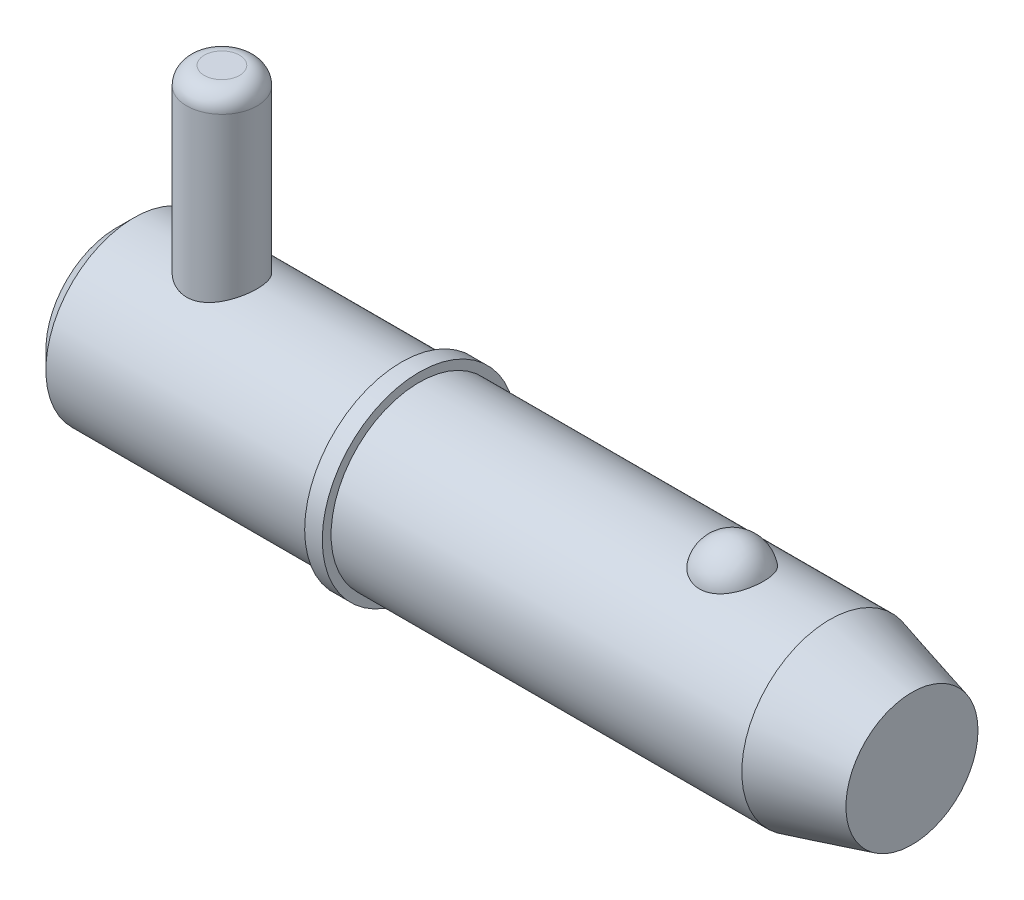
ISO-10303-21;
HEADER;
FILE_DESCRIPTION(('STEP AP214'),'2;1');
FILE_NAME('part.step','',(''),(''),'','','');
FILE_SCHEMA(('AUTOMOTIVE_DESIGN { 1 0 10303 214 1 1 1 1 }'));
ENDSEC;
DATA;
#1=APPLICATION_CONTEXT('core data for automotive mechanical design processes');
#2=APPLICATION_PROTOCOL_DEFINITION('international standard','automotive_design',2000,#1);
#3=PRODUCT_CONTEXT('',#1,'mechanical');
#4=PRODUCT('Part','Part','',(#3));
#5=PRODUCT_RELATED_PRODUCT_CATEGORY('part','',(#4));
#6=PRODUCT_DEFINITION_FORMATION('','',#4);
#7=PRODUCT_DEFINITION_CONTEXT('part definition',#1,'design');
#8=PRODUCT_DEFINITION('design','',#6,#7);
#9=PRODUCT_DEFINITION_SHAPE('','',#8);
#10=(LENGTH_UNIT() NAMED_UNIT(*) SI_UNIT(.MILLI.,.METRE.));
#11=(NAMED_UNIT(*) PLANE_ANGLE_UNIT() SI_UNIT($,.RADIAN.));
#12=(NAMED_UNIT(*) SI_UNIT($,.STERADIAN.) SOLID_ANGLE_UNIT());
#13=UNCERTAINTY_MEASURE_WITH_UNIT(LENGTH_MEASURE(1.E-05),#10,'distance_accuracy_value','');
#14=(GEOMETRIC_REPRESENTATION_CONTEXT(3) GLOBAL_UNCERTAINTY_ASSIGNED_CONTEXT((#13)) GLOBAL_UNIT_ASSIGNED_CONTEXT((#10,
#11,#12)) REPRESENTATION_CONTEXT('',''));
#15=CARTESIAN_POINT('',(0.,0.,0.));
#16=DIRECTION('',(0.,0.,1.));
#17=DIRECTION('',(1.,0.,0.));
#18=AXIS2_PLACEMENT_3D('',#15,#16,#17);
#19=CARTESIAN_POINT('',(9.525,23.81,0.));
#20=DIRECTION('',(0.,-1.,0.));
#21=DIRECTION('',(0.,0.,-1.));
#22=AXIS2_PLACEMENT_3D('',#19,#20,#21);
#23=CYLINDRICAL_SURFACE('',#22,3.175);
#24=CARTESIAN_POINT('',(9.525,-6.3525,0.));
#25=DIRECTION('',(0.,1.,0.));
#26=DIRECTION('',(0.,0.,1.));
#27=AXIS2_PLACEMENT_3D('',#24,#25,#26);
#28=CIRCLE('',#27,3.175);
#29=CARTESIAN_POINT('',(9.525,-6.3525,3.175));
#30=VERTEX_POINT('',#29);
#31=EDGE_CURVE('P0_E25',#30,#30,#28,.T.);
#32=ORIENTED_EDGE('',*,*,#31,.T.);
#33=EDGE_LOOP('',(#32));
#34=FACE_BOUND('',#33,.T.);
#35=CARTESIAN_POINT('',(9.525,22.2225,0.));
#36=DIRECTION('',(0.,1.,0.));
#37=DIRECTION('',(0.,0.,1.));
#38=AXIS2_PLACEMENT_3D('',#35,#36,#37);
#39=CIRCLE('',#38,3.175);
#40=CARTESIAN_POINT('',(9.525,22.2225,3.175));
#41=VERTEX_POINT('',#40);
#42=EDGE_CURVE('P0_E29',#41,#41,#39,.F.);
#43=ORIENTED_EDGE('',*,*,#42,.T.);
#44=EDGE_LOOP('',(#43));
#45=FACE_BOUND('',#44,.T.);
#46=ADVANCED_FACE('P0_F14',(#34,#45),#23,.T.);
#47=CARTESIAN_POINT('',(9.525,23.81,0.));
#48=DIRECTION('',(0.,1.,0.));
#49=DIRECTION('',(0.,0.,1.));
#50=AXIS2_PLACEMENT_3D('',#47,#48,#49);
#51=PLANE('',#50);
#52=CARTESIAN_POINT('',(9.525,23.81,0.));
#53=DIRECTION('',(0.,1.,0.));
#54=DIRECTION('',(0.,0.,1.));
#55=AXIS2_PLACEMENT_3D('',#52,#53,#54);
#56=CIRCLE('',#55,1.5875);
#57=CARTESIAN_POINT('',(9.525,23.81,1.5875));
#58=VERTEX_POINT('',#57);
#59=EDGE_CURVE('P0_E10',#58,#58,#56,.T.);
#60=ORIENTED_EDGE('',*,*,#59,.T.);
#61=EDGE_LOOP('',(#60));
#62=FACE_BOUND('',#61,.T.);
#63=ADVANCED_FACE('P0_F46',(#62),#51,.T.);
#64=CARTESIAN_POINT('',(9.525,-7.94,0.));
#65=DIRECTION('',(0.,1.,0.));
#66=DIRECTION('',(0.,0.,1.));
#67=AXIS2_PLACEMENT_3D('',#64,#65,#66);
#68=PLANE('',#67);
#69=CARTESIAN_POINT('',(9.525,-7.94,0.));
#70=DIRECTION('',(0.,1.,0.));
#71=DIRECTION('',(0.,0.,1.));
#72=AXIS2_PLACEMENT_3D('',#69,#70,#71);
#73=CIRCLE('',#72,1.5875);
#74=CARTESIAN_POINT('',(9.525,-7.94,1.5875));
#75=VERTEX_POINT('',#74);
#76=EDGE_CURVE('P0_E21',#75,#75,#73,.F.);
#77=ORIENTED_EDGE('',*,*,#76,.T.);
#78=EDGE_LOOP('',(#77));
#79=FACE_BOUND('',#78,.T.);
#80=ADVANCED_FACE('P0_F43',(#79),#68,.F.);
#81=CARTESIAN_POINT('',(9.525,-6.3525,0.));
#82=DIRECTION('',(0.,1.,0.));
#83=DIRECTION('',(0.,0.,1.));
#84=AXIS2_PLACEMENT_3D('',#81,#82,#83);
#85=DEGENERATE_TOROIDAL_SURFACE('',#84,1.5875,1.5875,.T.);
#86=ORIENTED_EDGE('',*,*,#76,.F.);
#87=EDGE_LOOP('',(#86));
#88=FACE_BOUND('',#87,.T.);
#89=ORIENTED_EDGE('',*,*,#31,.F.);
#90=EDGE_LOOP('',(#89));
#91=FACE_BOUND('',#90,.T.);
#92=ADVANCED_FACE('P0_F38',(#88,#91),#85,.T.);
#93=CARTESIAN_POINT('',(9.525,22.2225,0.));
#94=DIRECTION('',(0.,1.,0.));
#95=DIRECTION('',(0.,0.,1.));
#96=AXIS2_PLACEMENT_3D('',#93,#94,#95);
#97=DEGENERATE_TOROIDAL_SURFACE('',#96,1.5875,1.5875,.T.);
#98=ORIENTED_EDGE('',*,*,#42,.F.);
#99=EDGE_LOOP('',(#98));
#100=FACE_BOUND('',#99,.T.);
#101=ORIENTED_EDGE('',*,*,#59,.F.);
#102=EDGE_LOOP('',(#101));
#103=FACE_BOUND('',#102,.T.);
#104=ADVANCED_FACE('P0_F16',(#100,#103),#97,.T.);
#105=CLOSED_SHELL('',(#46,#63,#80,#92,#104));
#106=MANIFOLD_SOLID_BREP('P0_B1',#105);
#107=CARTESIAN_POINT('',(0.,0.,0.));
#108=DIRECTION('',(1.,0.,0.));
#109=DIRECTION('',(0.,0.,-1.));
#110=AXIS2_PLACEMENT_3D('',#107,#108,#109);
#111=CYLINDRICAL_SURFACE('',#110,7.94);
#112=CARTESIAN_POINT('',(64.3518791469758,0.,0.));
#113=DIRECTION('',(1.,0.,0.));
#114=DIRECTION('',(0.,0.,-1.));
#115=AXIS2_PLACEMENT_3D('',#112,#113,#114);
#116=CIRCLE('',#115,7.94);
#117=CARTESIAN_POINT('',(64.3518791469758,0.,-7.94));
#118=VERTEX_POINT('',#117);
#119=EDGE_CURVE('P1_E81',#118,#118,#116,.T.);
#120=ORIENTED_EDGE('',*,*,#119,.F.);
#121=EDGE_LOOP('',(#120));
#122=FACE_BOUND('',#121,.T.);
#123=CARTESIAN_POINT('',(27.31,0.,0.));
#124=DIRECTION('',(1.,0.,0.));
#125=DIRECTION('',(0.,0.,-1.));
#126=AXIS2_PLACEMENT_3D('',#123,#124,#125);
#127=CIRCLE('',#126,7.94);
#128=CARTESIAN_POINT('',(27.31,0.,-7.94));
#129=VERTEX_POINT('',#128);
#130=EDGE_CURVE('P1_E85',#129,#129,#127,.T.);
#131=ORIENTED_EDGE('',*,*,#130,.T.);
#132=EDGE_LOOP('',(#131));
#133=FACE_BOUND('',#132,.T.);
#134=CARTESIAN_POINT('',(55.5449074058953,7.37767842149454,2.93486986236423));
#135=CARTESIAN_POINT('',(55.3927496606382,7.3776732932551,2.93487505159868));
#136=CARTESIAN_POINT('',(55.2406329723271,7.38258419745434,2.92262454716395));
#137=CARTESIAN_POINT('',(54.9409284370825,7.40163229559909,2.87404196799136));
#138=CARTESIAN_POINT('',(54.7933394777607,7.41576720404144,2.83771585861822));
#139=CARTESIAN_POINT('',(54.5070187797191,7.4516157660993,2.74218769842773));
#140=CARTESIAN_POINT('',(54.3682745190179,7.47331841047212,2.68301886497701));
#141=CARTESIAN_POINT('',(54.1028822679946,7.52194082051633,2.54350967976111));
#142=CARTESIAN_POINT('',(53.9762366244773,7.5488615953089,2.46316523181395));
#143=CARTESIAN_POINT('',(53.7345349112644,7.60594671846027,2.2809037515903));
#144=CARTESIAN_POINT('',(53.6199065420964,7.63618114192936,2.17844211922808));
#145=CARTESIAN_POINT('',(53.4088787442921,7.69614046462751,1.95608495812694));
#146=CARTESIAN_POINT('',(53.3124826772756,7.72586526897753,1.83618622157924));
#147=CARTESIAN_POINT('',(53.1359381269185,7.78314821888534,1.57628086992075));
#148=CARTESIAN_POINT('',(53.0567072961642,7.81055035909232,1.43561546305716));
#149=CARTESIAN_POINT('',(52.9217979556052,7.85879631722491,1.14236334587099));
#150=CARTESIAN_POINT('',(52.8661216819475,7.87963951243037,0.989775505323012));
#151=CARTESIAN_POINT('',(52.7788121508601,7.91289645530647,0.674619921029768));
#152=CARTESIAN_POINT('',(52.7475309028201,7.925186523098,0.511941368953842));
#153=CARTESIAN_POINT('',(52.710975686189,7.93958930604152,0.183247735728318));
#154=CARTESIAN_POINT('',(52.7057012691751,7.94170219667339,0.0172327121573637));
#155=CARTESIAN_POINT('',(52.7212311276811,7.93554931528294,-0.31267286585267));
#156=CARTESIAN_POINT('',(52.7419253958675,7.92732732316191,-0.4765694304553));
#157=CARTESIAN_POINT('',(52.8087865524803,7.90141534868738,-0.798305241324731));
#158=CARTESIAN_POINT('',(52.8549539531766,7.88372517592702,-0.956144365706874));
#159=CARTESIAN_POINT('',(52.9718986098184,7.84066230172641,-1.26152073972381));
#160=CARTESIAN_POINT('',(53.0427046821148,7.81528060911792,-1.40904568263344));
#161=CARTESIAN_POINT('',(53.2074789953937,7.7594867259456,-1.68950598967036));
#162=CARTESIAN_POINT('',(53.3014488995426,7.72907417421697,-1.82244030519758));
#163=CARTESIAN_POINT('',(53.5108391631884,7.66640424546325,-2.07032792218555));
#164=CARTESIAN_POINT('',(53.6263152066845,7.63414223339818,-2.1852330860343));
#165=CARTESIAN_POINT('',(53.8759006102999,7.57149681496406,-2.39329737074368));
#166=CARTESIAN_POINT('',(54.0100080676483,7.54111321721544,-2.48645870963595));
#167=CARTESIAN_POINT('',(54.2901113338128,7.48650742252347,-2.64628132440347));
#168=CARTESIAN_POINT('',(54.4357605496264,7.46215900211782,-2.71350554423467));
#169=CARTESIAN_POINT('',(54.7374259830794,7.42171253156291,-2.82226614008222));
#170=CARTESIAN_POINT('',(54.8934383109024,7.40561140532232,-2.86381209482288));
#171=CARTESIAN_POINT('',(55.2029708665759,7.3842679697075,-2.9183907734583));
#172=CARTESIAN_POINT('',(55.3562229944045,7.37852109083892,-2.93275024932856));
#173=CARTESIAN_POINT('',(55.6630705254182,7.37700973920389,-2.93655208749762));
#174=CARTESIAN_POINT('',(55.8166658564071,7.38124333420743,-2.92599927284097));
#175=CARTESIAN_POINT('',(56.1149907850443,7.39890635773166,-2.88102897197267));
#176=CARTESIAN_POINT('',(56.2598480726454,7.41205491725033,-2.8473399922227));
#177=CARTESIAN_POINT('',(56.5416432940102,7.445801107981,-2.75788206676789));
#178=CARTESIAN_POINT('',(56.6785805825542,7.46639934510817,-2.70211132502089));
#179=CARTESIAN_POINT('',(56.9440619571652,7.51339098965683,-2.56858908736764));
#180=CARTESIAN_POINT('',(57.0723548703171,7.53990200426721,-2.49038067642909));
#181=CARTESIAN_POINT('',(57.3142440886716,7.59569503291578,-2.31462737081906));
#182=CARTESIAN_POINT('',(57.4278370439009,7.62497767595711,-2.21707808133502));
#183=CARTESIAN_POINT('',(57.64322156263,7.68489473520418,-1.99982049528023));
#184=CARTESIAN_POINT('',(57.7441488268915,7.71552419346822,-1.87925337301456));
#185=CARTESIAN_POINT('',(57.9251866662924,7.77353016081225,-1.62268826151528));
#186=CARTESIAN_POINT('',(58.0052934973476,7.80090608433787,-1.4866875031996));
#187=CARTESIAN_POINT('',(58.1453615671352,7.85047992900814,-1.19818413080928));
#188=CARTESIAN_POINT('',(58.2045877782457,7.8724818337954,-1.04529016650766));
#189=CARTESIAN_POINT('',(58.2979821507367,7.90785114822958,-0.731080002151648));
#190=CARTESIAN_POINT('',(58.3321497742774,7.92121837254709,-0.569763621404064));
#191=CARTESIAN_POINT('',(58.374795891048,7.93797834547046,-0.242812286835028));
#192=CARTESIAN_POINT('',(58.3832047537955,7.94134405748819,-0.0771668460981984));
#193=CARTESIAN_POINT('',(58.3739626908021,7.93767937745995,0.253276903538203));
#194=CARTESIAN_POINT('',(58.3563120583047,7.93064910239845,0.418075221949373));
#195=CARTESIAN_POINT('',(58.2954247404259,7.90695571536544,0.741525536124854));
#196=CARTESIAN_POINT('',(58.2522819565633,7.8903279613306,0.900197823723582));
#197=CARTESIAN_POINT('',(58.1413535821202,7.84916386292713,1.20759654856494));
#198=CARTESIAN_POINT('',(58.07356656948,7.82462706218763,1.35632241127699));
#199=CARTESIAN_POINT('',(57.9143718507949,7.7700669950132,1.64032869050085));
#200=CARTESIAN_POINT('',(57.8228616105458,7.7400200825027,1.77554712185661));
#201=CARTESIAN_POINT('',(57.6182960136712,7.67774175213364,2.02800648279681));
#202=CARTESIAN_POINT('',(57.5052410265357,7.64551037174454,2.14524772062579));
#203=CARTESIAN_POINT('',(57.2608318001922,7.58265895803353,2.35778002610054));
#204=CARTESIAN_POINT('',(57.1295833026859,7.5520309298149,2.45319004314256));
#205=CARTESIAN_POINT('',(56.851601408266,7.49579792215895,2.61999897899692));
#206=CARTESIAN_POINT('',(56.7048670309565,7.47019326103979,2.69139637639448));
#207=CARTESIAN_POINT('',(56.3929477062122,7.42622216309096,2.8105324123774));
#208=CARTESIAN_POINT('',(56.2272209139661,7.40825002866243,2.85700910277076));
#209=CARTESIAN_POINT('',(55.8892792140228,7.38398348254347,2.9191685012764));
#210=CARTESIAN_POINT('',(55.7170670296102,7.3776842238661,2.93486399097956));
#211=CARTESIAN_POINT('',(55.5449074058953,7.37767842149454,2.93486986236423));
#212=B_SPLINE_CURVE_WITH_KNOTS('',3,(#134,#135,#136,#137,#138,#139,#140,#141,#142,#143,#144,
#145,#146,#147,#148,#149,#150,#151,#152,#153,#154,#155,#156,#157,#158,#159,#160,#161,#162,#163,
#164,#165,#166,#167,#168,#169,#170,#171,#172,#173,#174,#175,#176,#177,#178,#179,#180,#181,#182,
#183,#184,#185,#186,#187,#188,#189,#190,#191,#192,#193,#194,#195,#196,#197,#198,#199,#200,#201,
#202,#203,#204,#205,#206,#207,#208,#209,#210,#211),.UNSPECIFIED.,.T.,.F.,(4,2,2,2,2,2,2,2,2,2,2,
2,2,2,2,2,2,2,2,2,2,2,2,2,2,2,2,2,2,2,2,2,2,2,2,2,2,2,4),(0.,0.45584132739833,0.911569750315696,
1.36663794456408,1.82179423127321,2.28978983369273,2.7578716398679,3.246853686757,
3.73588214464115,4.23184282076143,4.72779494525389,5.22165321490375,5.71552141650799,
6.20996917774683,6.70445245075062,7.20023431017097,7.69596557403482,8.18023418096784,
8.66432203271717,9.12410697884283,9.58380291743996,10.0296503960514,10.4755341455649,
10.9312349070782,11.3870393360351,11.8654416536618,12.3439299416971,12.8378875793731,
13.3318558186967,13.8271581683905,14.3224549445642,14.8159385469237,15.3094506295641,
15.8051323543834,16.3008055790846,16.7937101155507,17.2866458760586,17.8026240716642,
18.3183879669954),.UNSPECIFIED.);
#213=CARTESIAN_POINT('',(55.5449074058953,7.37767842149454,2.93486986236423));
#214=VERTEX_POINT('',#213);
#215=EDGE_CURVE('P1_E35',#214,#214,#212,.T.);
#216=ORIENTED_EDGE('',*,*,#215,.T.);
#217=EDGE_LOOP('',(#216));
#218=FACE_BOUND('',#217,.T.);
#219=ADVANCED_FACE('P1_F13',(#122,#133,#218),#111,.T.);
#220=CARTESIAN_POINT('',(0.,0.,0.));
#221=DIRECTION('',(-1.,0.,0.));
#222=DIRECTION('',(0.,0.,1.));
#223=AXIS2_PLACEMENT_3D('',#220,#221,#222);
#224=PLANE('',#223);
#225=CARTESIAN_POINT('',(0.,0.,0.));
#226=DIRECTION('',(1.,0.,0.));
#227=DIRECTION('',(0.,0.,-1.));
#228=AXIS2_PLACEMENT_3D('',#225,#226,#227);
#229=CIRCLE('',#228,6.352);
#230=CARTESIAN_POINT('',(0.,0.,-6.352));
#231=VERTEX_POINT('',#230);
#232=EDGE_CURVE('P1_E9',#231,#231,#229,.T.);
#233=ORIENTED_EDGE('',*,*,#232,.F.);
#234=EDGE_LOOP('',(#233));
#235=FACE_BOUND('',#234,.T.);
#236=ADVANCED_FACE('P1_F15',(#235),#224,.T.);
#237=CARTESIAN_POINT('',(1.58799999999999,0.,0.));
#238=DIRECTION('',(1.,0.,0.));
#239=DIRECTION('',(0.,0.,-1.));
#240=AXIS2_PLACEMENT_3D('',#237,#238,#239);
#241=CONICAL_SURFACE('',#240,7.94,0.78539816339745);
#242=ORIENTED_EDGE('',*,*,#232,.T.);
#243=EDGE_LOOP('',(#242));
#244=FACE_BOUND('',#243,.T.);
#245=CARTESIAN_POINT('',(1.58799999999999,0.,0.));
#246=DIRECTION('',(1.,0.,0.));
#247=DIRECTION('',(0.,0.,-1.));
#248=AXIS2_PLACEMENT_3D('',#245,#246,#247);
#249=CIRCLE('',#248,7.94);
#250=CARTESIAN_POINT('',(1.58799999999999,0.,-7.94));
#251=VERTEX_POINT('',#250);
#252=EDGE_CURVE('P1_E26',#251,#251,#249,.T.);
#253=ORIENTED_EDGE('',*,*,#252,.F.);
#254=EDGE_LOOP('',(#253));
#255=FACE_BOUND('',#254,.T.);
#256=ADVANCED_FACE('P1_F77',(#244,#255),#241,.T.);
#257=CARTESIAN_POINT('',(0.,0.,0.));
#258=DIRECTION('',(1.,0.,0.));
#259=DIRECTION('',(0.,0.,-1.));
#260=AXIS2_PLACEMENT_3D('',#257,#258,#259);
#261=CYLINDRICAL_SURFACE('',#260,7.94);
#262=CARTESIAN_POINT('',(9.525,-7.27756655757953,3.175));
#263=CARTESIAN_POINT('',(9.43992346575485,-7.27756715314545,3.17499935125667));
#264=CARTESIAN_POINT('',(9.35481882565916,-7.27906496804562,3.1715736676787));
#265=CARTESIAN_POINT('',(9.18524505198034,-7.28499816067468,3.15791803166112));
#266=CARTESIAN_POINT('',(9.100776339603,-7.28943533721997,3.14768391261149));
#267=CARTESIAN_POINT('',(8.84895715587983,-7.30698881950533,3.10684226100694));
#268=CARTESIAN_POINT('',(8.6834173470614,-7.32434654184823,3.06609574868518));
#269=CARTESIAN_POINT('',(8.36278910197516,-7.36806950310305,2.95945910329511));
#270=CARTESIAN_POINT('',(8.20766386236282,-7.39440078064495,2.89366366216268));
#271=CARTESIAN_POINT('',(7.91065319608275,-7.45304562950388,2.73907413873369));
#272=CARTESIAN_POINT('',(7.76876488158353,-7.48535789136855,2.65028508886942));
#273=CARTESIAN_POINT('',(7.49411086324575,-7.55439482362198,2.44679888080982));
#274=CARTESIAN_POINT('',(7.36219910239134,-7.59126138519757,2.33099745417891));
#275=CARTESIAN_POINT('',(7.11904234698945,-7.66408045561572,2.07909838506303));
#276=CARTESIAN_POINT('',(7.00780457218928,-7.70003264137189,1.94299368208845));
#277=CARTESIAN_POINT('',(6.80492173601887,-7.76867514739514,1.64775981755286));
#278=CARTESIAN_POINT('',(6.71422139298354,-7.80118112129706,1.48793473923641));
#279=CARTESIAN_POINT('',(6.56135788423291,-7.85754918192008,1.15376269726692));
#280=CARTESIAN_POINT('',(6.49918311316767,-7.88141478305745,0.979421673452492));
#281=CARTESIAN_POINT('',(6.40818142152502,-7.91680873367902,0.630115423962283));
#282=CARTESIAN_POINT('',(6.3778864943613,-7.9288781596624,0.455588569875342));
#283=CARTESIAN_POINT('',(6.34677743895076,-7.94127547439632,0.103539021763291));
#284=CARTESIAN_POINT('',(6.34595232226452,-7.94160773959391,-0.0739825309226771));
#285=CARTESIAN_POINT('',(6.37300128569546,-7.93082261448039,-0.416371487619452));
#286=CARTESIAN_POINT('',(6.39926693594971,-7.92034690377,-0.581389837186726));
#287=CARTESIAN_POINT('',(6.47701615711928,-7.88998770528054,-0.904449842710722));
#288=CARTESIAN_POINT('',(6.52850157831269,-7.87010352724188,-1.06249098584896));
#289=CARTESIAN_POINT('',(6.65586120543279,-7.82249343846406,-1.36995769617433));
#290=CARTESIAN_POINT('',(6.73209124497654,-7.79465387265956,-1.51921754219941));
#291=CARTESIAN_POINT('',(6.90644286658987,-7.73389606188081,-1.80321183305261));
#292=CARTESIAN_POINT('',(7.00457194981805,-7.70097607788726,-1.93794127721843));
#293=CARTESIAN_POINT('',(7.22744086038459,-7.63084889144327,-2.19843606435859));
#294=CARTESIAN_POINT('',(7.35350432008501,-7.59350211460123,-2.3230330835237));
#295=CARTESIAN_POINT('',(7.62488266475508,-7.52039654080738,-2.54979642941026));
#296=CARTESIAN_POINT('',(7.77020381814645,-7.48463826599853,-2.65195542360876));
#297=CARTESIAN_POINT('',(8.08119298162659,-7.41780943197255,-2.83361305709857));
#298=CARTESIAN_POINT('',(8.24731937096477,-7.38689959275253,-2.91239105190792));
#299=CARTESIAN_POINT('',(8.59204539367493,-7.33515216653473,-3.04038913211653));
#300=CARTESIAN_POINT('',(8.77063684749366,-7.31430804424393,-3.08962840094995));
#301=CARTESIAN_POINT('',(9.12356982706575,-7.28663831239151,-3.15431018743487));
#302=CARTESIAN_POINT('',(9.29750494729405,-7.2790344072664,-3.17163284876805));
#303=CARTESIAN_POINT('',(9.64592502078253,-7.27648884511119,-3.17747282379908));
#304=CARTESIAN_POINT('',(9.82040979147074,-7.28154335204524,-3.16599886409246));
#305=CARTESIAN_POINT('',(10.1545374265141,-7.30294638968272,-3.11628310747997));
#306=CARTESIAN_POINT('',(10.3144598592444,-7.31863587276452,-3.0796016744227));
#307=CARTESIAN_POINT('',(10.625774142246,-7.35872371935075,-2.98253618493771));
#308=CARTESIAN_POINT('',(10.7771640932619,-7.38312401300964,-2.92214687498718));
#309=CARTESIAN_POINT('',(11.0739599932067,-7.4390944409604,-2.77664664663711));
#310=CARTESIAN_POINT('',(11.2188745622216,-7.47091513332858,-2.69063278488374));
#311=CARTESIAN_POINT('',(11.4928722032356,-7.53775867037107,-2.49724834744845));
#312=CARTESIAN_POINT('',(11.6219487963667,-7.57278281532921,-2.38986907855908));
#313=CARTESIAN_POINT('',(11.8705091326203,-7.64520845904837,-2.1474449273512));
#314=CARTESIAN_POINT('',(11.9885816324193,-7.68259462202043,-2.01094304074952));
#315=CARTESIAN_POINT('',(12.2003631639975,-7.75309951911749,-1.71917041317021));
#316=CARTESIAN_POINT('',(12.2940712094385,-7.78621808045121,-1.56389891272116));
#317=CARTESIAN_POINT('',(12.4541161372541,-7.84456050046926,-1.23845027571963));
#318=CARTESIAN_POINT('',(12.5204600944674,-7.86978639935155,-1.06827700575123));
#319=CARTESIAN_POINT('',(12.6231407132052,-7.90943635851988,-0.717928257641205));
#320=CARTESIAN_POINT('',(12.6594936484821,-7.92386627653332,-0.537758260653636));
#321=CARTESIAN_POINT('',(12.6992281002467,-7.93967263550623,-0.185201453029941));
#322=CARTESIAN_POINT('',(12.7046050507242,-7.94183891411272,-0.0130732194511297));
#323=CARTESIAN_POINT('',(12.6875036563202,-7.9350072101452,0.329549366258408));
#324=CARTESIAN_POINT('',(12.6650295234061,-7.92601091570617,0.500043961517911));
#325=CARTESIAN_POINT('',(12.5942896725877,-7.89825976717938,0.829196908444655));
#326=CARTESIAN_POINT('',(12.5468364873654,-7.87981280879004,0.988057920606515));
#327=CARTESIAN_POINT('',(12.4283390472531,-7.83513565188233,1.29553461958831));
#328=CARTESIAN_POINT('',(12.3572904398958,-7.8089040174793,1.44414841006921));
#329=CARTESIAN_POINT('',(12.1900822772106,-7.7497911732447,1.73412879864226));
#330=CARTESIAN_POINT('',(12.0929519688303,-7.71666737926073,1.87488510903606));
#331=CARTESIAN_POINT('',(11.8777894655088,-7.64775894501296,2.13869231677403));
#332=CARTESIAN_POINT('',(11.7597486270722,-7.61197320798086,2.26173585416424));
#333=CARTESIAN_POINT('',(11.4974896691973,-7.53902341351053,2.49449755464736));
#334=CARTESIAN_POINT('',(11.3521039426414,-7.50191102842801,2.60292060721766));
#335=CARTESIAN_POINT('',(11.0440201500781,-7.43289551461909,2.79392602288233));
#336=CARTESIAN_POINT('',(10.8813200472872,-7.40099299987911,2.87650534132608));
#337=CARTESIAN_POINT('',(10.558064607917,-7.3489506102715,3.00682739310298));
#338=CARTESIAN_POINT('',(10.398627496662,-7.32801197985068,3.05703164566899));
#339=CARTESIAN_POINT('',(10.0731242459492,-7.29639491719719,3.13175843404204));
#340=CARTESIAN_POINT('',(9.90707793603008,-7.28568789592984,3.15635254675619));
#341=CARTESIAN_POINT('',(9.70441566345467,-7.27968826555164,3.17013149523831));
#342=CARTESIAN_POINT('',(9.66856669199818,-7.27889378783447,3.17195593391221));
#343=CARTESIAN_POINT('',(9.59681348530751,-7.27783278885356,3.17439036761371));
#344=CARTESIAN_POINT('',(9.56090924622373,-7.27756630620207,3.17500027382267));
#345=CARTESIAN_POINT('',(9.525,-7.27756655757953,3.175));
#346=B_SPLINE_CURVE_WITH_KNOTS('',3,(#262,#263,#264,#265,#266,#267,#268,#269,#270,#271,#272,
#273,#274,#275,#276,#277,#278,#279,#280,#281,#282,#283,#284,#285,#286,#287,#288,#289,#290,#291,
#292,#293,#294,#295,#296,#297,#298,#299,#300,#301,#302,#303,#304,#305,#306,#307,#308,#309,#310,
#311,#312,#313,#314,#315,#316,#317,#318,#319,#320,#321,#322,#323,#324,#325,#326,#327,#328,#329,
#330,#331,#332,#333,#334,#335,#336,#337,#338,#339,#340,#341,#342,#343,#344,#345),.UNSPECIFIED.,
.T.,.F.,(4,2,2,2,2,2,2,2,2,2,2,2,2,2,2,2,2,2,2,2,2,2,2,2,2,2,2,2,2,2,2,2,2,2,2,2,2,2,2,2,2,4),
(0.,0.255187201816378,0.510530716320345,1.0218798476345,1.53131482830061,2.04063840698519,
2.57635929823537,3.11226692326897,3.66929090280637,4.22608806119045,4.75594400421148,
5.28560237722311,5.78552836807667,6.28549104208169,6.79298787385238,7.30065880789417,
7.8416422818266,8.38280228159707,8.93923025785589,9.49529647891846,10.0174074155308,
10.5393601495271,11.0316114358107,11.5239718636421,12.0362920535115,12.5488211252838,
13.0991799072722,13.6495609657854,14.1997996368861,14.7497395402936,15.2638187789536,
15.7778202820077,16.2760504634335,16.7743726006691,17.294711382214,17.8152657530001,
18.3680208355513,18.9208410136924,19.4240423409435,19.9258334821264,20.0335354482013,
20.1412452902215),.UNSPECIFIED.);
#347=CARTESIAN_POINT('',(9.525,-7.27756655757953,3.175));
#348=VERTEX_POINT('',#347);
#349=EDGE_CURVE('P1_E17',#348,#348,#346,.T.);
#350=ORIENTED_EDGE('',*,*,#349,.F.);
#351=EDGE_LOOP('',(#350));
#352=FACE_BOUND('',#351,.T.);
#353=CARTESIAN_POINT('',(9.525,7.27756655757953,3.175));
#354=CARTESIAN_POINT('',(9.61007653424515,7.27756715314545,3.17499935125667));
#355=CARTESIAN_POINT('',(9.69518117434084,7.27906496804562,3.1715736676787));
#356=CARTESIAN_POINT('',(9.86475494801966,7.28499816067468,3.15791803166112));
#357=CARTESIAN_POINT('',(9.949223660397,7.28943533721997,3.14768391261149));
#358=CARTESIAN_POINT('',(10.2010428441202,7.30698881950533,3.10684226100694));
#359=CARTESIAN_POINT('',(10.3665826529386,7.32434654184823,3.06609574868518));
#360=CARTESIAN_POINT('',(10.6872108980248,7.36806950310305,2.95945910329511));
#361=CARTESIAN_POINT('',(10.8423361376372,7.39440078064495,2.89366366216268));
#362=CARTESIAN_POINT('',(11.1393468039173,7.45304562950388,2.73907413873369));
#363=CARTESIAN_POINT('',(11.2812351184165,7.48535789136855,2.65028508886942));
#364=CARTESIAN_POINT('',(11.5558891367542,7.55439482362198,2.44679888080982));
#365=CARTESIAN_POINT('',(11.6878008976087,7.59126138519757,2.33099745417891));
#366=CARTESIAN_POINT('',(11.9309576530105,7.66408045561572,2.07909838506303));
#367=CARTESIAN_POINT('',(12.0421954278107,7.70003264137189,1.94299368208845));
#368=CARTESIAN_POINT('',(12.2450782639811,7.76867514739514,1.64775981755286));
#369=CARTESIAN_POINT('',(12.3357786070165,7.80118112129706,1.48793473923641));
#370=CARTESIAN_POINT('',(12.4886421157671,7.85754918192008,1.15376269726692));
#371=CARTESIAN_POINT('',(12.5508168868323,7.88141478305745,0.979421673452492));
#372=CARTESIAN_POINT('',(12.641818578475,7.91680873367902,0.630115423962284));
#373=CARTESIAN_POINT('',(12.6721135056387,7.9288781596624,0.455588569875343));
#374=CARTESIAN_POINT('',(12.7032225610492,7.94127547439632,0.103539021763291));
#375=CARTESIAN_POINT('',(12.7040476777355,7.94160773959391,-0.0739825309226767));
#376=CARTESIAN_POINT('',(12.6769987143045,7.93082261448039,-0.416371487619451));
#377=CARTESIAN_POINT('',(12.6507330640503,7.92034690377,-0.581389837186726));
#378=CARTESIAN_POINT('',(12.5729838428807,7.88998770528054,-0.904449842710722));
#379=CARTESIAN_POINT('',(12.5214984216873,7.87010352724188,-1.06249098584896));
#380=CARTESIAN_POINT('',(12.3941387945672,7.82249343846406,-1.36995769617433));
#381=CARTESIAN_POINT('',(12.3179087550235,7.79465387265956,-1.51921754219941));
#382=CARTESIAN_POINT('',(12.1435571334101,7.73389606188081,-1.80321183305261));
#383=CARTESIAN_POINT('',(12.0454280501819,7.70097607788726,-1.93794127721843));
#384=CARTESIAN_POINT('',(11.8225591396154,7.63084889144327,-2.19843606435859));
#385=CARTESIAN_POINT('',(11.696495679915,7.59350211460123,-2.3230330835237));
#386=CARTESIAN_POINT('',(11.4251173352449,7.52039654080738,-2.54979642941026));
#387=CARTESIAN_POINT('',(11.2797961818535,7.48463826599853,-2.65195542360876));
#388=CARTESIAN_POINT('',(10.9688070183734,7.41780943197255,-2.83361305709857));
#389=CARTESIAN_POINT('',(10.8026806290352,7.38689959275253,-2.91239105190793));
#390=CARTESIAN_POINT('',(10.4579546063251,7.33515216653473,-3.04038913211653));
#391=CARTESIAN_POINT('',(10.2793631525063,7.31430804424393,-3.08962840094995));
#392=CARTESIAN_POINT('',(9.92643017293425,7.28663831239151,-3.15431018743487));
#393=CARTESIAN_POINT('',(9.75249505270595,7.2790344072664,-3.17163284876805));
#394=CARTESIAN_POINT('',(9.40407497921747,7.2764888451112,-3.17747282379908));
#395=CARTESIAN_POINT('',(9.22959020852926,7.28154335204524,-3.16599886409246));
#396=CARTESIAN_POINT('',(8.89546257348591,7.30294638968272,-3.11628310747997));
#397=CARTESIAN_POINT('',(8.73554014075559,7.31863587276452,-3.0796016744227));
#398=CARTESIAN_POINT('',(8.42422585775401,7.35872371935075,-2.98253618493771));
#399=CARTESIAN_POINT('',(8.27283590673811,7.38312401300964,-2.92214687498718));
#400=CARTESIAN_POINT('',(7.97604000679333,7.4390944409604,-2.77664664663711));
#401=CARTESIAN_POINT('',(7.83112543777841,7.47091513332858,-2.69063278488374));
#402=CARTESIAN_POINT('',(7.55712779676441,7.53775867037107,-2.49724834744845));
#403=CARTESIAN_POINT('',(7.42805120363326,7.57278281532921,-2.38986907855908));
#404=CARTESIAN_POINT('',(7.17949086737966,7.64520845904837,-2.1474449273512));
#405=CARTESIAN_POINT('',(7.06141836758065,7.68259462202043,-2.01094304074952));
#406=CARTESIAN_POINT('',(6.8496368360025,7.75309951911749,-1.71917041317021));
#407=CARTESIAN_POINT('',(6.75592879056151,7.78621808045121,-1.56389891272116));
#408=CARTESIAN_POINT('',(6.59588386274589,7.84456050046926,-1.23845027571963));
#409=CARTESIAN_POINT('',(6.52953990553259,7.86978639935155,-1.06827700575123));
#410=CARTESIAN_POINT('',(6.42685928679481,7.90943635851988,-0.717928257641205));
#411=CARTESIAN_POINT('',(6.39050635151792,7.92386627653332,-0.537758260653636));
#412=CARTESIAN_POINT('',(6.35077189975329,7.93967263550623,-0.18520145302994));
#413=CARTESIAN_POINT('',(6.34539494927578,7.94183891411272,-0.0130732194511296));
#414=CARTESIAN_POINT('',(6.36249634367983,7.9350072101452,0.329549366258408));
#415=CARTESIAN_POINT('',(6.38497047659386,7.92601091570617,0.500043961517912));
#416=CARTESIAN_POINT('',(6.45571032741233,7.89825976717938,0.829196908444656));
#417=CARTESIAN_POINT('',(6.50316351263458,7.87981280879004,0.988057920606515));
#418=CARTESIAN_POINT('',(6.62166095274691,7.83513565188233,1.29553461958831));
#419=CARTESIAN_POINT('',(6.69270956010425,7.8089040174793,1.44414841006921));
#420=CARTESIAN_POINT('',(6.85991772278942,7.7497911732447,1.73412879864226));
#421=CARTESIAN_POINT('',(6.95704803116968,7.71666737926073,1.87488510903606));
#422=CARTESIAN_POINT('',(7.17221053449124,7.64775894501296,2.13869231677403));
#423=CARTESIAN_POINT('',(7.29025137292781,7.61197320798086,2.26173585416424));
#424=CARTESIAN_POINT('',(7.55251033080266,7.53902341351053,2.49449755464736));
#425=CARTESIAN_POINT('',(7.69789605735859,7.50191102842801,2.60292060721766));
#426=CARTESIAN_POINT('',(8.00597984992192,7.43289551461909,2.79392602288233));
#427=CARTESIAN_POINT('',(8.16867995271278,7.40099299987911,2.87650534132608));
#428=CARTESIAN_POINT('',(8.49193539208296,7.3489506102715,3.00682739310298));
#429=CARTESIAN_POINT('',(8.65137250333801,7.32801197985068,3.05703164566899));
#430=CARTESIAN_POINT('',(8.97687575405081,7.29639491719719,3.13175843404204));
#431=CARTESIAN_POINT('',(9.14292206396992,7.28568789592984,3.15635254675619));
#432=CARTESIAN_POINT('',(9.34558433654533,7.27968826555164,3.17013149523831));
#433=CARTESIAN_POINT('',(9.38143330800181,7.27889378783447,3.17195593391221));
#434=CARTESIAN_POINT('',(9.45318651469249,7.27783278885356,3.17439036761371));
#435=CARTESIAN_POINT('',(9.48909075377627,7.27756630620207,3.17500027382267));
#436=CARTESIAN_POINT('',(9.525,7.27756655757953,3.175));
#437=B_SPLINE_CURVE_WITH_KNOTS('',3,(#353,#354,#355,#356,#357,#358,#359,#360,#361,#362,#363,
#364,#365,#366,#367,#368,#369,#370,#371,#372,#373,#374,#375,#376,#377,#378,#379,#380,#381,#382,
#383,#384,#385,#386,#387,#388,#389,#390,#391,#392,#393,#394,#395,#396,#397,#398,#399,#400,#401,
#402,#403,#404,#405,#406,#407,#408,#409,#410,#411,#412,#413,#414,#415,#416,#417,#418,#419,#420,
#421,#422,#423,#424,#425,#426,#427,#428,#429,#430,#431,#432,#433,#434,#435,#436),.UNSPECIFIED.,
.T.,.F.,(4,2,2,2,2,2,2,2,2,2,2,2,2,2,2,2,2,2,2,2,2,2,2,2,2,2,2,2,2,2,2,2,2,2,2,2,2,2,2,2,2,4),
(0.,0.255187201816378,0.510530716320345,1.0218798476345,1.53131482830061,2.04063840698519,
2.57635929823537,3.11226692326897,3.66929090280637,4.22608806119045,4.75594400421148,
5.2856023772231,5.78552836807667,6.28549104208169,6.79298787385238,7.30065880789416,
7.8416422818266,8.38280228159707,8.9392302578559,9.49529647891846,10.0174074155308,
10.5393601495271,11.0316114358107,11.5239718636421,12.0362920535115,12.5488211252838,
13.0991799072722,13.6495609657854,14.1997996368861,14.7497395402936,15.2638187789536,
15.7778202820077,16.2760504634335,16.7743726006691,17.294711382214,17.8152657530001,
18.3680208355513,18.9208410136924,19.4240423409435,19.9258334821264,20.0335354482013,
20.1412452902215),.UNSPECIFIED.);
#438=CARTESIAN_POINT('',(9.525,7.27756655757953,3.175));
#439=VERTEX_POINT('',#438);
#440=EDGE_CURVE('P1_E43',#439,#439,#437,.T.);
#441=ORIENTED_EDGE('',*,*,#440,.F.);
#442=EDGE_LOOP('',(#441));
#443=FACE_BOUND('',#442,.T.);
#444=ORIENTED_EDGE('',*,*,#252,.T.);
#445=EDGE_LOOP('',(#444));
#446=FACE_BOUND('',#445,.T.);
#447=CARTESIAN_POINT('',(25.722,0.,0.));
#448=DIRECTION('',(1.,0.,0.));
#449=DIRECTION('',(0.,0.,-1.));
#450=AXIS2_PLACEMENT_3D('',#447,#448,#449);
#451=CIRCLE('',#450,7.94);
#452=CARTESIAN_POINT('',(25.722,0.,-7.94));
#453=VERTEX_POINT('',#452);
#454=EDGE_CURVE('P1_E31',#453,#453,#451,.T.);
#455=ORIENTED_EDGE('',*,*,#454,.F.);
#456=EDGE_LOOP('',(#455));
#457=FACE_BOUND('',#456,.T.);
#458=ADVANCED_FACE('P1_F103',(#352,#443,#446,#457),#261,.T.);
#459=CARTESIAN_POINT('',(25.722,7.94,0.));
#460=DIRECTION('',(-1.,0.,0.));
#461=DIRECTION('',(0.,0.,1.));
#462=AXIS2_PLACEMENT_3D('',#459,#460,#461);
#463=PLANE('',#462);
#464=ORIENTED_EDGE('',*,*,#454,.T.);
#465=EDGE_LOOP('',(#464));
#466=FACE_BOUND('',#465,.T.);
#467=CARTESIAN_POINT('',(25.722,0.,0.));
#468=DIRECTION('',(1.,0.,0.));
#469=DIRECTION('',(0.,0.,-1.));
#470=AXIS2_PLACEMENT_3D('',#467,#468,#469);
#471=CIRCLE('',#470,8.734);
#472=CARTESIAN_POINT('',(25.722,0.,-8.734));
#473=VERTEX_POINT('',#472);
#474=EDGE_CURVE('P1_E91',#473,#473,#471,.T.);
#475=ORIENTED_EDGE('',*,*,#474,.F.);
#476=EDGE_LOOP('',(#475));
#477=FACE_BOUND('',#476,.T.);
#478=ADVANCED_FACE('P1_F100',(#466,#477),#463,.T.);
#479=CARTESIAN_POINT('',(0.,0.,0.));
#480=DIRECTION('',(1.,0.,0.));
#481=DIRECTION('',(0.,0.,-1.));
#482=AXIS2_PLACEMENT_3D('',#479,#480,#481);
#483=CYLINDRICAL_SURFACE('',#482,8.734);
#484=ORIENTED_EDGE('',*,*,#474,.T.);
#485=EDGE_LOOP('',(#484));
#486=FACE_BOUND('',#485,.T.);
#487=CARTESIAN_POINT('',(27.31,0.,0.));
#488=DIRECTION('',(1.,0.,0.));
#489=DIRECTION('',(0.,0.,-1.));
#490=AXIS2_PLACEMENT_3D('',#487,#488,#489);
#491=CIRCLE('',#490,8.734);
#492=CARTESIAN_POINT('',(27.31,0.,-8.734));
#493=VERTEX_POINT('',#492);
#494=EDGE_CURVE('P1_E88',#493,#493,#491,.T.);
#495=ORIENTED_EDGE('',*,*,#494,.F.);
#496=EDGE_LOOP('',(#495));
#497=FACE_BOUND('',#496,.T.);
#498=ADVANCED_FACE('P1_F68',(#486,#497),#483,.T.);
#499=CARTESIAN_POINT('',(27.31,8.734,0.));
#500=DIRECTION('',(1.,0.,0.));
#501=DIRECTION('',(0.,0.,-1.));
#502=AXIS2_PLACEMENT_3D('',#499,#500,#501);
#503=PLANE('',#502);
#504=ORIENTED_EDGE('',*,*,#494,.T.);
#505=EDGE_LOOP('',(#504));
#506=FACE_BOUND('',#505,.T.);
#507=ORIENTED_EDGE('',*,*,#130,.F.);
#508=EDGE_LOOP('',(#507));
#509=FACE_BOUND('',#508,.T.);
#510=ADVANCED_FACE('P1_F62',(#506,#509),#503,.T.);
#511=CARTESIAN_POINT('',(71.76,0.,0.));
#512=DIRECTION('',(-1.,0.,0.));
#513=DIRECTION('',(0.,0.,1.));
#514=AXIS2_PLACEMENT_3D('',#511,#512,#513);
#515=CONICAL_SURFACE('',#514,5.95500000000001,0.26179938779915);
#516=ORIENTED_EDGE('',*,*,#119,.T.);
#517=EDGE_LOOP('',(#516));
#518=FACE_BOUND('',#517,.T.);
#519=CARTESIAN_POINT('',(71.76,0.,0.));
#520=DIRECTION('',(1.,0.,0.));
#521=DIRECTION('',(0.,0.,-1.));
#522=AXIS2_PLACEMENT_3D('',#519,#520,#521);
#523=CIRCLE('',#522,5.95500000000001);
#524=CARTESIAN_POINT('',(71.76,0.,-5.95500000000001));
#525=VERTEX_POINT('',#524);
#526=EDGE_CURVE('P1_E42',#525,#525,#523,.T.);
#527=ORIENTED_EDGE('',*,*,#526,.F.);
#528=EDGE_LOOP('',(#527));
#529=FACE_BOUND('',#528,.T.);
#530=ADVANCED_FACE('P1_F59',(#518,#529),#515,.T.);
#531=CARTESIAN_POINT('',(71.76,5.95500000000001,0.));
#532=DIRECTION('',(1.,0.,0.));
#533=DIRECTION('',(0.,0.,-1.));
#534=AXIS2_PLACEMENT_3D('',#531,#532,#533);
#535=PLANE('',#534);
#536=ORIENTED_EDGE('',*,*,#526,.T.);
#537=EDGE_LOOP('',(#536));
#538=FACE_BOUND('',#537,.T.);
#539=ADVANCED_FACE('P1_F55',(#538),#535,.T.);
#540=CARTESIAN_POINT('',(55.5449074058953,7.146,0.));
#541=DIRECTION('',(-1.,0.,0.));
#542=DIRECTION('',(0.,1.,0.));
#543=AXIS2_PLACEMENT_3D('',#540,#541,#542);
#544=SPHERICAL_SURFACE('',#543,2.944);
#545=ORIENTED_EDGE('',*,*,#215,.F.);
#546=EDGE_LOOP('',(#545));
#547=FACE_BOUND('',#546,.T.);
#548=ADVANCED_FACE('P1_F50',(#547),#544,.T.);
#549=CARTESIAN_POINT('',(9.525,-8.734,0.));
#550=DIRECTION('',(0.,1.,0.));
#551=DIRECTION('',(0.,0.,1.));
#552=AXIS2_PLACEMENT_3D('',#549,#550,#551);
#553=CYLINDRICAL_SURFACE('',#552,3.175);
#554=ORIENTED_EDGE('',*,*,#349,.T.);
#555=EDGE_LOOP('',(#554));
#556=FACE_BOUND('',#555,.T.);
#557=ORIENTED_EDGE('',*,*,#440,.T.);
#558=EDGE_LOOP('',(#557));
#559=FACE_BOUND('',#558,.T.);
#560=ADVANCED_FACE('P1_F54',(#556,#559),#553,.F.);
#561=CLOSED_SHELL('',(#219,#236,#256,#458,#478,#498,#510,#530,#539,#548,#560));
#562=MANIFOLD_SOLID_BREP('P1_B1',#561);
#563=ADVANCED_BREP_SHAPE_REPRESENTATION('',(#18,#106,#562),#14);
#564=SHAPE_DEFINITION_REPRESENTATION(#9,#563);
ENDSEC;
END-ISO-10303-21;
